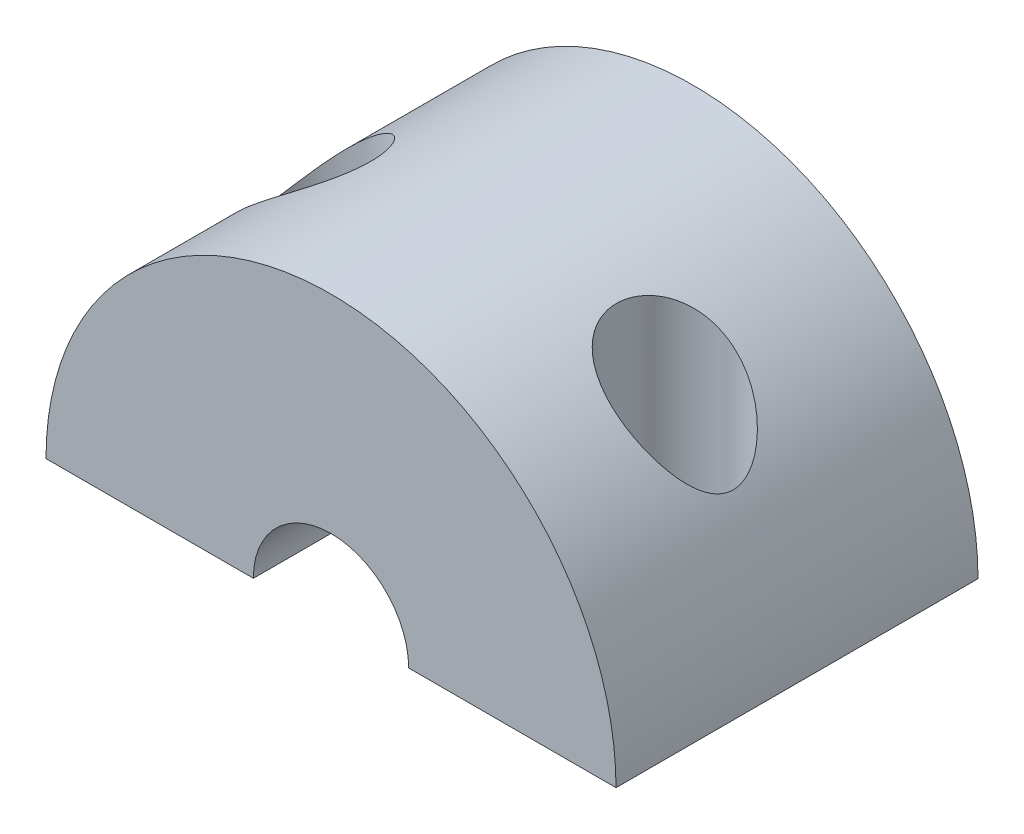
ISO-10303-21;
HEADER;
FILE_DESCRIPTION(('STEP AP214'),'2;1');
FILE_NAME('part.step','',(''),(''),'','','');
FILE_SCHEMA(('AUTOMOTIVE_DESIGN { 1 0 10303 214 1 1 1 1 }'));
ENDSEC;
DATA;
#1=APPLICATION_CONTEXT('core data for automotive mechanical design processes');
#2=APPLICATION_PROTOCOL_DEFINITION('international standard','automotive_design',2000,#1);
#3=PRODUCT_CONTEXT('',#1,'mechanical');
#4=PRODUCT('Part','Part','',(#3));
#5=PRODUCT_RELATED_PRODUCT_CATEGORY('part','',(#4));
#6=PRODUCT_DEFINITION_FORMATION('','',#4);
#7=PRODUCT_DEFINITION_CONTEXT('part definition',#1,'design');
#8=PRODUCT_DEFINITION('design','',#6,#7);
#9=PRODUCT_DEFINITION_SHAPE('','',#8);
#10=(LENGTH_UNIT() NAMED_UNIT(*) SI_UNIT(.MILLI.,.METRE.));
#11=(NAMED_UNIT(*) PLANE_ANGLE_UNIT() SI_UNIT($,.RADIAN.));
#12=(NAMED_UNIT(*) SI_UNIT($,.STERADIAN.) SOLID_ANGLE_UNIT());
#13=UNCERTAINTY_MEASURE_WITH_UNIT(LENGTH_MEASURE(1.E-05),#10,'distance_accuracy_value','');
#14=(GEOMETRIC_REPRESENTATION_CONTEXT(3) GLOBAL_UNCERTAINTY_ASSIGNED_CONTEXT((#13)) GLOBAL_UNIT_ASSIGNED_CONTEXT((#10,
#11,#12)) REPRESENTATION_CONTEXT('',''));
#15=CARTESIAN_POINT('',(0.,0.,0.));
#16=DIRECTION('',(0.,0.,1.));
#17=DIRECTION('',(1.,0.,0.));
#18=AXIS2_PLACEMENT_3D('',#15,#16,#17);
#19=CARTESIAN_POINT('',(2.725,0.,12.7));
#20=DIRECTION('',(0.,1.,0.));
#21=DIRECTION('',(0.,0.,1.));
#22=AXIS2_PLACEMENT_3D('',#19,#20,#21);
#23=PLANE('',#22);
#24=CARTESIAN_POINT('',(6.3625,0.,7.));
#25=DIRECTION('',(0.,-1.,0.));
#26=DIRECTION('',(0.,0.,1.));
#27=AXIS2_PLACEMENT_3D('',#24,#25,#26);
#28=CIRCLE('',#27,2.05);
#29=CARTESIAN_POINT('',(6.3625,0.,9.05));
#30=VERTEX_POINT('',#29);
#31=EDGE_CURVE('E146',#30,#30,#28,.T.);
#32=ORIENTED_EDGE('',*,*,#31,.F.);
#33=EDGE_LOOP('',(#32));
#34=FACE_BOUND('',#33,.T.);
#35=DIRECTION('',(1.,0.,0.));
#36=VECTOR('',#35,1.);
#37=CARTESIAN_POINT('',(2.725,0.,0.));
#38=LINE('',#37,#36);
#39=CARTESIAN_POINT('',(2.725,0.,0.));
#40=VERTEX_POINT('',#39);
#41=CARTESIAN_POINT('',(10.,0.,0.));
#42=VERTEX_POINT('',#41);
#43=EDGE_CURVE('E119',#40,#42,#38,.T.);
#44=ORIENTED_EDGE('',*,*,#43,.T.);
#45=DIRECTION('',(0.,0.,-1.));
#46=VECTOR('',#45,1.);
#47=CARTESIAN_POINT('',(10.,0.,12.7));
#48=LINE('',#47,#46);
#49=CARTESIAN_POINT('',(10.,0.,12.7));
#50=VERTEX_POINT('',#49);
#51=EDGE_CURVE('E11',#50,#42,#48,.T.);
#52=ORIENTED_EDGE('',*,*,#51,.F.);
#53=DIRECTION('',(1.,0.,0.));
#54=VECTOR('',#53,1.);
#55=CARTESIAN_POINT('',(2.725,0.,12.7));
#56=LINE('',#55,#54);
#57=CARTESIAN_POINT('',(2.725,0.,12.7));
#58=VERTEX_POINT('',#57);
#59=EDGE_CURVE('E100',#58,#50,#56,.T.);
#60=ORIENTED_EDGE('',*,*,#59,.F.);
#61=DIRECTION('',(0.,0.,-1.));
#62=VECTOR('',#61,1.);
#63=CARTESIAN_POINT('',(2.725,0.,12.7));
#64=LINE('',#63,#62);
#65=EDGE_CURVE('E67',#58,#40,#64,.T.);
#66=ORIENTED_EDGE('',*,*,#65,.T.);
#67=EDGE_LOOP('',(#44,#52,#60,#66));
#68=FACE_BOUND('',#67,.T.);
#69=ADVANCED_FACE('F45',(#34,#68),#23,.F.);
#70=CARTESIAN_POINT('',(0.,0.,12.7));
#71=DIRECTION('',(0.,0.,-1.));
#72=DIRECTION('',(-1.,0.,0.));
#73=AXIS2_PLACEMENT_3D('',#70,#71,#72);
#74=CYLINDRICAL_SURFACE('',#73,10.);
#75=CARTESIAN_POINT('',(-6.3625,7.71482946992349,4.95));
#76=CARTESIAN_POINT('',(-6.22789997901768,7.82582957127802,4.94999992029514));
#77=CARTESIAN_POINT('',(-6.09027888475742,7.93336559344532,4.96323208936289));
#78=CARTESIAN_POINT('',(-5.81358151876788,8.13828982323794,5.01983749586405));
#79=CARTESIAN_POINT('',(-5.67450741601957,8.23569128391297,5.06317078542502));
#80=CARTESIAN_POINT('',(-5.43834276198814,8.3927901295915,5.16687610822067));
#81=CARTESIAN_POINT('',(-5.33996266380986,8.45560836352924,5.2196026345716));
#82=CARTESIAN_POINT('',(-5.14977632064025,8.5727613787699,5.34330437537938));
#83=CARTESIAN_POINT('',(-5.05796630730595,8.62710104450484,5.4142690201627));
#84=CARTESIAN_POINT('',(-4.88454925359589,8.72646876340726,5.57445536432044));
#85=CARTESIAN_POINT('',(-4.80301056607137,8.7714356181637,5.66378992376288));
#86=CARTESIAN_POINT('',(-4.65532079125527,8.85070863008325,5.8585345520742));
#87=CARTESIAN_POINT('',(-4.58916283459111,8.88501954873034,5.96393740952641));
#88=CARTESIAN_POINT('',(-4.48252148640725,8.93925008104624,6.17502189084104));
#89=CARTESIAN_POINT('',(-4.44000556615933,8.96034301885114,6.27937866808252));
#90=CARTESIAN_POINT('',(-4.37248139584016,8.99348870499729,6.49496161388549));
#91=CARTESIAN_POINT('',(-4.34746496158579,9.00554567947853,6.60618454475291));
#92=CARTESIAN_POINT('',(-4.31733109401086,9.02002813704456,6.82389808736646));
#93=CARTESIAN_POINT('',(-4.31094178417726,9.02306948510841,6.93017395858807));
#94=CARTESIAN_POINT('',(-4.31469978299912,9.02127332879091,7.14235494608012));
#95=CARTESIAN_POINT('',(-4.32484378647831,9.016437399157,7.24826013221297));
#96=CARTESIAN_POINT('',(-4.36085418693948,8.99907400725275,7.45462175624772));
#97=CARTESIAN_POINT('',(-4.38642057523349,8.98669326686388,7.55514327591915));
#98=CARTESIAN_POINT('',(-4.45189571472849,8.95443727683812,7.75011138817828));
#99=CARTESIAN_POINT('',(-4.49180449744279,8.93456201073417,7.84455796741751));
#100=CARTESIAN_POINT('',(-4.58513064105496,8.88703300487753,8.02670532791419));
#101=CARTESIAN_POINT('',(-4.63878490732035,8.8592417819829,8.11424842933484));
#102=CARTESIAN_POINT('',(-4.75697164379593,8.79634540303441,8.27868660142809));
#103=CARTESIAN_POINT('',(-4.8215061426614,8.76123888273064,8.35557968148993));
#104=CARTESIAN_POINT('',(-4.96310973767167,8.68184892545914,8.50172259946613));
#105=CARTESIAN_POINT('',(-5.04069899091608,8.63714083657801,8.57023559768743));
#106=CARTESIAN_POINT('',(-5.20235949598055,8.54074473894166,8.69319301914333));
#107=CARTESIAN_POINT('',(-5.28643272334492,8.48905459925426,8.74763313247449));
#108=CARTESIAN_POINT('',(-5.46815698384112,8.37329779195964,8.84786508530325));
#109=CARTESIAN_POINT('',(-5.56626476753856,8.30849212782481,8.89196917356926));
#110=CARTESIAN_POINT('',(-5.76408993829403,8.17249881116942,8.96354175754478));
#111=CARTESIAN_POINT('',(-5.86380855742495,8.10130606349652,8.99099683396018));
#112=CARTESIAN_POINT('',(-6.10539811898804,7.92182927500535,9.03897673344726));
#113=CARTESIAN_POINT('',(-6.24686874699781,7.81080819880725,9.05138375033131));
#114=CARTESIAN_POINT('',(-6.52338136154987,7.58142076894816,9.04836655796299));
#115=CARTESIAN_POINT('',(-6.65841401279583,7.46304428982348,9.03290312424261));
#116=CARTESIAN_POINT('',(-6.9208220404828,7.22042784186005,8.97711979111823));
#117=CARTESIAN_POINT('',(-7.04807610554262,7.09613191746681,8.93648168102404));
#118=CARTESIAN_POINT('',(-7.29134211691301,6.84592980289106,8.83229183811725));
#119=CARTESIAN_POINT('',(-7.40734655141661,6.72002259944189,8.76872492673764));
#120=CARTESIAN_POINT('',(-7.57007650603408,6.53456143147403,8.65782750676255));
#121=CARTESIAN_POINT('',(-7.62176004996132,6.47417041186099,8.61894898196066));
#122=CARTESIAN_POINT('',(-7.72188745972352,6.35441022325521,8.53583868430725));
#123=CARTESIAN_POINT('',(-7.77033259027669,6.2950406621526,8.49160902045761));
#124=CARTESIAN_POINT('',(-7.86365491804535,6.17806779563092,8.39764549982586));
#125=CARTESIAN_POINT('',(-7.90853756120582,6.12046188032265,8.34792033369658));
#126=CARTESIAN_POINT('',(-7.99441283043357,6.00785906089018,8.24256829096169));
#127=CARTESIAN_POINT('',(-8.03540809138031,5.95286040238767,8.18694546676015));
#128=CARTESIAN_POINT('',(-8.11622284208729,5.84225922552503,8.06432889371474));
#129=CARTESIAN_POINT('',(-8.1556576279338,5.78699049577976,7.99677330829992));
#130=CARTESIAN_POINT('',(-8.22817121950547,5.68341282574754,7.85335411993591));
#131=CARTESIAN_POINT('',(-8.26125694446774,5.63509632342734,7.77749970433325));
#132=CARTESIAN_POINT('',(-8.31333514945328,5.55789273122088,7.63351038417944));
#133=CARTESIAN_POINT('',(-8.33382641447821,5.52705318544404,7.56698512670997));
#134=CARTESIAN_POINT('',(-8.36840424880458,5.47455991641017,7.42882426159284));
#135=CARTESIAN_POINT('',(-8.38250206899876,5.45289006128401,7.35719788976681));
#136=CARTESIAN_POINT('',(-8.40138742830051,5.42373904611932,7.22207488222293));
#137=CARTESIAN_POINT('',(-8.4073041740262,5.41454173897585,7.1591125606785));
#138=CARTESIAN_POINT('',(-8.41322767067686,5.40533388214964,7.03224813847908));
#139=CARTESIAN_POINT('',(-8.41323768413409,5.40531826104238,6.96834657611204));
#140=CARTESIAN_POINT('',(-8.40735458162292,5.41446342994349,6.84159030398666));
#141=CARTESIAN_POINT('',(-8.40146940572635,5.42361187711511,6.77873430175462));
#142=CARTESIAN_POINT('',(-8.38431296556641,5.45009541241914,6.65553912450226));
#143=CARTESIAN_POINT('',(-8.37303652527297,5.46743836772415,6.5952024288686));
#144=CARTESIAN_POINT('',(-8.34009379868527,5.51761405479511,6.45323920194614));
#145=CARTESIAN_POINT('',(-8.31605047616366,5.55389562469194,6.37339654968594));
#146=CARTESIAN_POINT('',(-8.26065890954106,5.63595271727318,6.22149313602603));
#147=CARTESIAN_POINT('',(-8.22929176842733,5.68175276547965,6.14945322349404));
#148=CARTESIAN_POINT('',(-8.16739615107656,5.77026681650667,6.02601234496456));
#149=CARTESIAN_POINT('',(-8.13786138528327,5.81188701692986,5.97330338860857));
#150=CARTESIAN_POINT('',(-8.07556782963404,5.8981391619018,5.87243070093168));
#151=CARTESIAN_POINT('',(-8.04280706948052,5.94277294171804,5.82426978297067));
#152=CARTESIAN_POINT('',(-7.94015919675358,6.08003830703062,5.6859513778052));
#153=CARTESIAN_POINT('',(-7.86599272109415,6.17590861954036,5.60212307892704));
#154=CARTESIAN_POINT('',(-7.72992883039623,6.3448086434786,5.47063769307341));
#155=CARTESIAN_POINT('',(-7.67023717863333,6.41689978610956,5.41936296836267));
#156=CARTESIAN_POINT('',(-7.54624566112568,6.56226235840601,5.32448696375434));
#157=CARTESIAN_POINT('',(-7.48194364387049,6.63553432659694,5.28088929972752));
#158=CARTESIAN_POINT('',(-7.34919925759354,6.78225983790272,5.20141797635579));
#159=CARTESIAN_POINT('',(-7.28076354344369,6.85571291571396,5.16553230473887));
#160=CARTESIAN_POINT('',(-7.13995186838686,7.0022438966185,5.10156677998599));
#161=CARTESIAN_POINT('',(-7.06757557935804,7.07532176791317,5.07348757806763));
#162=CARTESIAN_POINT('',(-6.894037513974,7.24510344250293,5.01735828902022));
#163=CARTESIAN_POINT('',(-6.79142795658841,7.3414272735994,4.99253832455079));
#164=CARTESIAN_POINT('',(-6.58072060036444,7.53088401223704,4.95885713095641));
#165=CARTESIAN_POINT('',(-6.47262137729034,7.62401608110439,4.95000006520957));
#166=CARTESIAN_POINT('',(-6.3625,7.71482946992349,4.95));
#167=B_SPLINE_CURVE_WITH_KNOTS('',3,(#75,#76,#77,#78,#79,#80,#81,#82,#83,#84,#85,#86,#87,#88,
#89,#90,#91,#92,#93,#94,#95,#96,#97,#98,#99,#100,#101,#102,#103,#104,#105,#106,#107,#108,#109,
#110,#111,#112,#113,#114,#115,#116,#117,#118,#119,#120,#121,#122,#123,#124,#125,#126,#127,#128,
#129,#130,#131,#132,#133,#134,#135,#136,#137,#138,#139,#140,#141,#142,#143,#144,#145,#146,#147,
#148,#149,#150,#151,#152,#153,#154,#155,#156,#157,#158,#159,#160,#161,#162,#163,#164,#165,#166),
.UNSPECIFIED.,.T.,.F.,(4,2,2,2,2,2,2,2,2,2,2,2,2,2,2,2,2,2,2,2,2,2,2,2,2,2,2,2,2,2,2,2,2,2,2,2,
2,2,2,2,2,2,2,2,2,4),(0.,0.522927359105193,1.04516205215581,1.42786943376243,1.81035552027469,
2.19526574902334,2.58000373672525,2.92211330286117,3.26406276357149,3.58204391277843,
3.8999615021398,4.21188561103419,4.52381040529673,4.84152280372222,5.15929450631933,
5.49615943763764,5.83312741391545,6.20841918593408,6.5840130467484,7.12186542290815,
7.66047535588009,8.20603634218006,8.75195914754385,9.01724016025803,9.28241695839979,
9.54718024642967,9.81176277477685,10.0984609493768,10.3848448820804,10.6124666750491,
10.8396863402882,11.0305287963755,11.2212658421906,11.4117463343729,11.6024100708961,
11.8736828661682,12.1456634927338,12.3654623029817,12.585396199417,13.0259295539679,
13.3457666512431,13.6657539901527,13.9852392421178,14.3047511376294,14.7324662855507,
15.1602929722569),.UNSPECIFIED.);
#168=CARTESIAN_POINT('',(-6.3625,7.71482946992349,4.95));
#169=VERTEX_POINT('',#168);
#170=EDGE_CURVE('E137',#169,#169,#167,.T.);
#171=ORIENTED_EDGE('',*,*,#170,.T.);
#172=EDGE_LOOP('',(#171));
#173=FACE_BOUND('',#172,.T.);
#174=CARTESIAN_POINT('',(6.3625,7.71482946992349,4.95));
#175=CARTESIAN_POINT('',(6.49607731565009,7.6046619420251,4.94999828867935));
#176=CARTESIAN_POINT('',(6.62680097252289,7.49098560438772,4.96303691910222));
#177=CARTESIAN_POINT('',(6.8799884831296,7.25915469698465,5.0121891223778));
#178=CARTESIAN_POINT('',(7.00243495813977,7.14099147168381,5.04834967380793));
#179=CARTESIAN_POINT('',(7.18768609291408,6.95316910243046,5.12199512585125));
#180=CARTESIAN_POINT('',(7.25389625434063,6.88403447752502,5.15251249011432));
#181=CARTESIAN_POINT('',(7.38267657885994,6.74573939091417,5.22038269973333));
#182=CARTESIAN_POINT('',(7.44524758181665,6.67657893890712,5.25773395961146));
#183=CARTESIAN_POINT('',(7.56647025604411,6.53887896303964,5.33919073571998));
#184=CARTESIAN_POINT('',(7.62512403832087,6.47033912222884,5.38329257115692));
#185=CARTESIAN_POINT('',(7.73822819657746,6.33463678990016,5.47838024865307));
#186=CARTESIAN_POINT('',(7.79268051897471,6.26747367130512,5.52936287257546));
#187=CARTESIAN_POINT('',(7.90982635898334,6.11928115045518,5.65198438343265));
#188=CARTESIAN_POINT('',(7.97126483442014,6.03889179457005,5.72562249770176));
#189=CARTESIAN_POINT('',(8.08576182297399,5.88469386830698,5.88531945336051));
#190=CARTESIAN_POINT('',(8.13883183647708,5.81087632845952,5.97136093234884));
#191=CARTESIAN_POINT('',(8.22050292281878,5.69445807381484,6.13060538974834));
#192=CARTESIAN_POINT('',(8.25174367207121,5.64899987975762,6.2003360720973));
#193=CARTESIAN_POINT('',(8.30740469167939,5.56681955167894,6.3473187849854));
#194=CARTESIAN_POINT('',(8.33183728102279,5.53008165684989,6.42455688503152));
#195=CARTESIAN_POINT('',(8.36717092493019,5.47642521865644,6.56665237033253));
#196=CARTESIAN_POINT('',(8.37991174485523,5.45686672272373,6.63003883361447));
#197=CARTESIAN_POINT('',(8.39943204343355,5.42677338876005,6.75980013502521));
#198=CARTESIAN_POINT('',(8.40621908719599,5.41622709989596,6.82617106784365));
#199=CARTESIAN_POINT('',(8.41322489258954,5.4053395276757,6.96045474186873));
#200=CARTESIAN_POINT('',(8.41341090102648,5.40504913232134,7.02837349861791));
#201=CARTESIAN_POINT('',(8.4071133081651,5.4148383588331,7.16315055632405));
#202=CARTESIAN_POINT('',(8.40062541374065,5.42492465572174,7.23000814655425));
#203=CARTESIAN_POINT('',(8.38017884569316,5.45646369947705,7.3704494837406));
#204=CARTESIAN_POINT('',(8.36525261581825,5.47938377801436,7.4435548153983));
#205=CARTESIAN_POINT('',(8.32880432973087,5.53462832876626,7.58434938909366));
#206=CARTESIAN_POINT('',(8.30726993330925,5.56697038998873,7.65202819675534));
#207=CARTESIAN_POINT('',(8.24635105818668,5.65702633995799,7.8152700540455));
#208=CARTESIAN_POINT('',(8.20350579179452,5.71919127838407,7.90704796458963));
#209=CARTESIAN_POINT('',(8.10873320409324,5.85279468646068,8.07832770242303));
#210=CARTESIAN_POINT('',(8.05678183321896,5.92425758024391,8.15779594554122));
#211=CARTESIAN_POINT('',(7.95636616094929,6.05820471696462,8.29136982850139));
#212=CARTESIAN_POINT('',(7.90917418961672,6.11974845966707,8.34740704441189));
#213=CARTESIAN_POINT('',(7.81055836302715,6.24512147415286,8.45287453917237));
#214=CARTESIAN_POINT('',(7.75913208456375,6.30895204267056,8.50230099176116));
#215=CARTESIAN_POINT('',(7.65240573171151,6.43798885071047,8.59487749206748));
#216=CARTESIAN_POINT('',(7.59710320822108,6.50319594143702,8.6380235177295));
#217=CARTESIAN_POINT('',(7.48291387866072,6.63427279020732,8.71814908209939));
#218=CARTESIAN_POINT('',(7.42402568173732,6.70014279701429,8.75512620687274));
#219=CARTESIAN_POINT('',(7.23765468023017,6.90295609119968,8.85941162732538));
#220=CARTESIAN_POINT('',(7.10452893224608,7.04012912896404,8.9165573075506));
#221=CARTESIAN_POINT('',(6.82591475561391,7.31057603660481,9.0022314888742));
#222=CARTESIAN_POINT('',(6.6804409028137,7.44385426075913,9.03079323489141));
#223=CARTESIAN_POINT('',(6.4052881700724,7.68111780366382,9.0533853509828));
#224=CARTESIAN_POINT('',(6.27704072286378,7.78627242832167,9.05239508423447));
#225=CARTESIAN_POINT('',(6.01714223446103,7.98880493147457,9.02490755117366));
#226=CARTESIAN_POINT('',(5.88549557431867,8.08619221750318,8.99844166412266));
#227=CARTESIAN_POINT('',(5.64746437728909,8.25368718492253,8.92452474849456));
#228=CARTESIAN_POINT('',(5.5408495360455,8.32553146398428,8.8817787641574));
#229=CARTESIAN_POINT('',(5.33217950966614,8.46069024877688,8.77611729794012));
#230=CARTESIAN_POINT('',(5.23012302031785,8.52400720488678,8.71320762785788));
#231=CARTESIAN_POINT('',(5.03441402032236,8.64105266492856,8.56644520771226));
#232=CARTESIAN_POINT('',(4.94083025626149,8.69470571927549,8.48243897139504));
#233=CARTESIAN_POINT('',(4.76826990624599,8.79052730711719,8.29503258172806));
#234=CARTESIAN_POINT('',(4.68928265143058,8.83270423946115,8.19164670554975));
#235=CARTESIAN_POINT('',(4.56023337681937,8.89993658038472,7.98351033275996));
#236=CARTESIAN_POINT('',(4.50772218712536,8.92652257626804,7.88076764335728));
#237=CARTESIAN_POINT('',(4.42030628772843,8.97013374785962,7.66616715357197));
#238=CARTESIAN_POINT('',(4.38539138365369,8.98716446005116,7.55431467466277));
#239=CARTESIAN_POINT('',(4.33730838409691,9.01046080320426,7.3354590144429));
#240=CARTESIAN_POINT('',(4.32248990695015,9.01754538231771,7.22890200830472));
#241=CARTESIAN_POINT('',(4.30974520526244,9.02364407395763,7.01456375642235));
#242=CARTESIAN_POINT('',(4.31181448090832,9.02266033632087,6.90678284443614));
#243=CARTESIAN_POINT('',(4.3324292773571,9.01277840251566,6.69643227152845));
#244=CARTESIAN_POINT('',(4.35048452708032,9.00411570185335,6.59380284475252));
#245=CARTESIAN_POINT('',(4.4015969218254,8.97923966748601,6.39332096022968));
#246=CARTESIAN_POINT('',(4.43465353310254,8.96302660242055,6.2954683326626));
#247=CARTESIAN_POINT('',(4.51472339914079,8.92296379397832,6.10619771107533));
#248=CARTESIAN_POINT('',(4.56186766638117,8.8990421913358,6.01485055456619));
#249=CARTESIAN_POINT('',(4.66799001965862,8.84383601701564,5.84179221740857));
#250=CARTESIAN_POINT('',(4.72696952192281,8.81255056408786,5.76008219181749));
#251=CARTESIAN_POINT('',(4.85754101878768,8.74128572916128,5.60413531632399));
#252=CARTESIAN_POINT('',(4.92960791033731,8.70095670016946,5.53045743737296));
#253=CARTESIAN_POINT('',(5.08136885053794,8.61320930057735,5.3964207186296));
#254=CARTESIAN_POINT('',(5.1610656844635,8.56578833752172,5.33606676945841));
#255=CARTESIAN_POINT('',(5.33358289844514,8.4595586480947,5.22363846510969));
#256=CARTESIAN_POINT('',(5.42691950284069,8.40008593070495,5.17298950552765));
#257=CARTESIAN_POINT('',(5.61641512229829,8.27458828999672,5.08775902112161));
#258=CARTESIAN_POINT('',(5.71257495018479,8.20856146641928,5.05318217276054));
#259=CARTESIAN_POINT('',(5.90196850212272,8.07340388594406,5.00006000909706));
#260=CARTESIAN_POINT('',(5.99519227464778,8.00445133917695,4.98101620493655));
#261=CARTESIAN_POINT('',(6.18021391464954,7.86247918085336,4.95598654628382));
#262=CARTESIAN_POINT('',(6.27201173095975,7.78945942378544,4.95000115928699));
#263=CARTESIAN_POINT('',(6.3625,7.71482946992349,4.95));
#264=B_SPLINE_CURVE_WITH_KNOTS('',3,(#174,#175,#176,#177,#178,#179,#180,#181,#182,#183,#184,
#185,#186,#187,#188,#189,#190,#191,#192,#193,#194,#195,#196,#197,#198,#199,#200,#201,#202,#203,
#204,#205,#206,#207,#208,#209,#210,#211,#212,#213,#214,#215,#216,#217,#218,#219,#220,#221,#222,
#223,#224,#225,#226,#227,#228,#229,#230,#231,#232,#233,#234,#235,#236,#237,#238,#239,#240,#241,
#242,#243,#244,#245,#246,#247,#248,#249,#250,#251,#252,#253,#254,#255,#256,#257,#258,#259,#260,
#261,#262,#263),.UNSPECIFIED.,.T.,.F.,(4,2,2,2,2,2,2,2,2,2,2,2,2,2,2,2,2,2,2,2,2,2,2,2,2,2,2,2,
2,2,2,2,2,2,2,2,2,2,2,2,2,2,2,2,4),(0.,0.51910212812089,1.03926232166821,1.34042110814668,
1.6415101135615,1.94243552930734,2.24322068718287,2.61779002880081,2.99184004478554,
3.25782659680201,3.52332868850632,3.72518152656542,3.92677750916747,4.12937363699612,
4.33210017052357,4.56497615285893,4.79828968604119,5.15284164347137,5.5083444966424,
5.79501687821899,6.0818544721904,6.36887495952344,6.6560074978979,7.25202307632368,
7.84734464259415,8.34302869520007,8.83810297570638,9.24292675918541,9.64763396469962,
10.0553754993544,10.462817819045,10.816105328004,11.1691879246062,11.4910396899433,
11.8128056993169,12.1250326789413,12.4372485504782,12.7524634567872,13.0677161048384,
13.3983468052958,13.7290986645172,14.0928264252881,14.4566599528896,14.8082987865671,
15.1599502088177),.UNSPECIFIED.);
#265=CARTESIAN_POINT('',(6.3625,7.71482946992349,4.95));
#266=VERTEX_POINT('',#265);
#267=EDGE_CURVE('E48',#266,#266,#264,.T.);
#268=ORIENTED_EDGE('',*,*,#267,.T.);
#269=EDGE_LOOP('',(#268));
#270=FACE_BOUND('',#269,.T.);
#271=CARTESIAN_POINT('',(0.,0.,0.));
#272=DIRECTION('',(0.,0.,1.));
#273=DIRECTION('',(1.,0.,0.));
#274=AXIS2_PLACEMENT_3D('',#271,#272,#273);
#275=CIRCLE('',#274,10.);
#276=CARTESIAN_POINT('',(-10.,0.,0.));
#277=VERTEX_POINT('',#276);
#278=EDGE_CURVE('E106',#42,#277,#275,.T.);
#279=ORIENTED_EDGE('',*,*,#278,.T.);
#280=DIRECTION('',(0.,0.,-1.));
#281=VECTOR('',#280,1.);
#282=CARTESIAN_POINT('',(-10.,0.,12.7));
#283=LINE('',#282,#281);
#284=CARTESIAN_POINT('',(-10.,0.,12.7));
#285=VERTEX_POINT('',#284);
#286=EDGE_CURVE('E59',#285,#277,#283,.T.);
#287=ORIENTED_EDGE('',*,*,#286,.F.);
#288=CARTESIAN_POINT('',(0.,0.,12.7));
#289=DIRECTION('',(0.,0.,1.));
#290=DIRECTION('',(1.,0.,0.));
#291=AXIS2_PLACEMENT_3D('',#288,#289,#290);
#292=CIRCLE('',#291,10.);
#293=EDGE_CURVE('E93',#50,#285,#292,.T.);
#294=ORIENTED_EDGE('',*,*,#293,.F.);
#295=ORIENTED_EDGE('',*,*,#51,.T.);
#296=EDGE_LOOP('',(#279,#287,#294,#295));
#297=FACE_BOUND('',#296,.T.);
#298=ADVANCED_FACE('F105',(#173,#270,#297),#74,.T.);
#299=CARTESIAN_POINT('',(-10.,0.,12.7));
#300=DIRECTION('',(0.,1.,0.));
#301=DIRECTION('',(0.,0.,1.));
#302=AXIS2_PLACEMENT_3D('',#299,#300,#301);
#303=PLANE('',#302);
#304=CARTESIAN_POINT('',(-6.3625,0.,7.));
#305=DIRECTION('',(0.,-1.,0.));
#306=DIRECTION('',(0.,0.,-1.));
#307=AXIS2_PLACEMENT_3D('',#304,#305,#306);
#308=CIRCLE('',#307,2.05);
#309=CARTESIAN_POINT('',(-6.3625,0.,4.95));
#310=VERTEX_POINT('',#309);
#311=EDGE_CURVE('E145',#310,#310,#308,.T.);
#312=ORIENTED_EDGE('',*,*,#311,.F.);
#313=EDGE_LOOP('',(#312));
#314=FACE_BOUND('',#313,.T.);
#315=DIRECTION('',(1.,0.,0.));
#316=VECTOR('',#315,1.);
#317=CARTESIAN_POINT('',(-10.,0.,0.));
#318=LINE('',#317,#316);
#319=CARTESIAN_POINT('',(-2.725,0.,0.));
#320=VERTEX_POINT('',#319);
#321=EDGE_CURVE('E124',#277,#320,#318,.T.);
#322=ORIENTED_EDGE('',*,*,#321,.T.);
#323=DIRECTION('',(0.,0.,-1.));
#324=VECTOR('',#323,1.);
#325=CARTESIAN_POINT('',(-2.725,0.,12.7));
#326=LINE('',#325,#324);
#327=CARTESIAN_POINT('',(-2.725,0.,12.7));
#328=VERTEX_POINT('',#327);
#329=EDGE_CURVE('E82',#328,#320,#326,.T.);
#330=ORIENTED_EDGE('',*,*,#329,.F.);
#331=DIRECTION('',(1.,0.,0.));
#332=VECTOR('',#331,1.);
#333=CARTESIAN_POINT('',(-10.,0.,12.7));
#334=LINE('',#333,#332);
#335=EDGE_CURVE('E99',#285,#328,#334,.T.);
#336=ORIENTED_EDGE('',*,*,#335,.F.);
#337=ORIENTED_EDGE('',*,*,#286,.T.);
#338=EDGE_LOOP('',(#322,#330,#336,#337));
#339=FACE_BOUND('',#338,.T.);
#340=ADVANCED_FACE('F111',(#314,#339),#303,.F.);
#341=CARTESIAN_POINT('',(0.,0.,12.7));
#342=DIRECTION('',(0.,0.,-1.));
#343=DIRECTION('',(-1.,0.,0.));
#344=AXIS2_PLACEMENT_3D('',#341,#342,#343);
#345=CYLINDRICAL_SURFACE('',#344,2.725);
#346=CARTESIAN_POINT('',(0.,0.,0.));
#347=DIRECTION('',(0.,0.,1.));
#348=DIRECTION('',(1.,0.,0.));
#349=AXIS2_PLACEMENT_3D('',#346,#347,#348);
#350=CIRCLE('',#349,2.725);
#351=EDGE_CURVE('E127',#40,#320,#350,.T.);
#352=ORIENTED_EDGE('',*,*,#351,.F.);
#353=ORIENTED_EDGE('',*,*,#65,.F.);
#354=CARTESIAN_POINT('',(0.,0.,12.7));
#355=DIRECTION('',(0.,0.,1.));
#356=DIRECTION('',(1.,0.,0.));
#357=AXIS2_PLACEMENT_3D('',#354,#355,#356);
#358=CIRCLE('',#357,2.725);
#359=EDGE_CURVE('E113',#58,#328,#358,.T.);
#360=ORIENTED_EDGE('',*,*,#359,.T.);
#361=ORIENTED_EDGE('',*,*,#329,.T.);
#362=EDGE_LOOP('',(#352,#353,#360,#361));
#363=FACE_BOUND('',#362,.T.);
#364=ADVANCED_FACE('F162',(#363),#345,.F.);
#365=CARTESIAN_POINT('',(0.,0.,12.7));
#366=DIRECTION('',(0.,0.,1.));
#367=DIRECTION('',(1.,0.,0.));
#368=AXIS2_PLACEMENT_3D('',#365,#366,#367);
#369=PLANE('',#368);
#370=ORIENTED_EDGE('',*,*,#59,.T.);
#371=ORIENTED_EDGE('',*,*,#293,.T.);
#372=ORIENTED_EDGE('',*,*,#335,.T.);
#373=ORIENTED_EDGE('',*,*,#359,.F.);
#374=EDGE_LOOP('',(#370,#371,#372,#373));
#375=FACE_BOUND('',#374,.T.);
#376=ADVANCED_FACE('F96',(#375),#369,.T.);
#377=CARTESIAN_POINT('',(0.,0.,0.));
#378=DIRECTION('',(0.,0.,1.));
#379=DIRECTION('',(1.,0.,0.));
#380=AXIS2_PLACEMENT_3D('',#377,#378,#379);
#381=PLANE('',#380);
#382=ORIENTED_EDGE('',*,*,#43,.F.);
#383=ORIENTED_EDGE('',*,*,#351,.T.);
#384=ORIENTED_EDGE('',*,*,#321,.F.);
#385=ORIENTED_EDGE('',*,*,#278,.F.);
#386=EDGE_LOOP('',(#382,#383,#384,#385));
#387=FACE_BOUND('',#386,.T.);
#388=ADVANCED_FACE('F154',(#387),#381,.F.);
#389=CARTESIAN_POINT('',(-6.3625,10.,7.));
#390=DIRECTION('',(0.,-1.,0.));
#391=DIRECTION('',(0.,0.,-1.));
#392=AXIS2_PLACEMENT_3D('',#389,#390,#391);
#393=CYLINDRICAL_SURFACE('',#392,2.05);
#394=ORIENTED_EDGE('',*,*,#311,.T.);
#395=EDGE_LOOP('',(#394));
#396=FACE_BOUND('',#395,.T.);
#397=ORIENTED_EDGE('',*,*,#170,.F.);
#398=EDGE_LOOP('',(#397));
#399=FACE_BOUND('',#398,.T.);
#400=ADVANCED_FACE('F150',(#396,#399),#393,.F.);
#401=CARTESIAN_POINT('',(6.3625,10.,7.));
#402=DIRECTION('',(0.,-1.,0.));
#403=DIRECTION('',(0.,0.,-1.));
#404=AXIS2_PLACEMENT_3D('',#401,#402,#403);
#405=CYLINDRICAL_SURFACE('',#404,2.05);
#406=ORIENTED_EDGE('',*,*,#31,.T.);
#407=EDGE_LOOP('',(#406));
#408=FACE_BOUND('',#407,.T.);
#409=ORIENTED_EDGE('',*,*,#267,.F.);
#410=EDGE_LOOP('',(#409));
#411=FACE_BOUND('',#410,.T.);
#412=ADVANCED_FACE('F153',(#408,#411),#405,.F.);
#413=CLOSED_SHELL('',(#69,#298,#340,#364,#376,#388,#400,#412));
#414=MANIFOLD_SOLID_BREP('B2',#413);
#415=ADVANCED_BREP_SHAPE_REPRESENTATION('',(#18,#414),#14);
#416=SHAPE_DEFINITION_REPRESENTATION(#9,#415);
ENDSEC;
END-ISO-10303-21;
